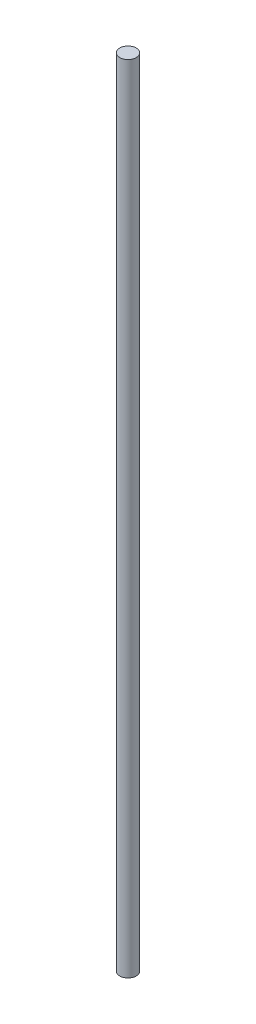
from build123d import *

# Parameters (mm, degrees)
SKETCH1_R           = 3.175
BOSS_EXTRUDE1_DEPTH = 304.8


with BuildPart() as part:
    # Sketch1 → Boss-Extrude1 (new body)
    with BuildSketch(Plane(origin=(0, 0, 0), x_dir=(1, 0, 0), z_dir=(0, 1, 0))):
        with Locations(Location((0, 0, 0), (0, 0, 270))):
            Circle(SKETCH1_R)
    extrude(amount=BOSS_EXTRUDE1_DEPTH)


solid = part.part
